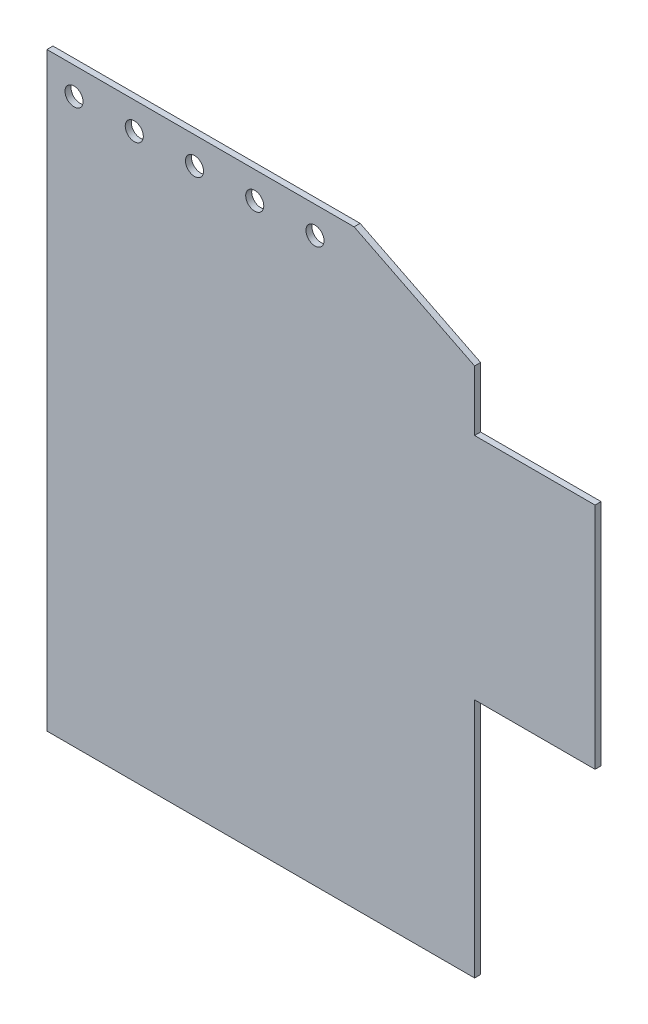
ISO-10303-21;
HEADER;
FILE_DESCRIPTION(('STEP AP214'),'2;1');
FILE_NAME('part.step','',(''),(''),'','','');
FILE_SCHEMA(('AUTOMOTIVE_DESIGN { 1 0 10303 214 1 1 1 1 }'));
ENDSEC;
DATA;
#1=APPLICATION_CONTEXT('core data for automotive mechanical design processes');
#2=APPLICATION_PROTOCOL_DEFINITION('international standard','automotive_design',2000,#1);
#3=PRODUCT_CONTEXT('',#1,'mechanical');
#4=PRODUCT('Part','Part','',(#3));
#5=PRODUCT_RELATED_PRODUCT_CATEGORY('part','',(#4));
#6=PRODUCT_DEFINITION_FORMATION('','',#4);
#7=PRODUCT_DEFINITION_CONTEXT('part definition',#1,'design');
#8=PRODUCT_DEFINITION('design','',#6,#7);
#9=PRODUCT_DEFINITION_SHAPE('','',#8);
#10=(LENGTH_UNIT() NAMED_UNIT(*) SI_UNIT(.MILLI.,.METRE.));
#11=(NAMED_UNIT(*) PLANE_ANGLE_UNIT() SI_UNIT($,.RADIAN.));
#12=(NAMED_UNIT(*) SI_UNIT($,.STERADIAN.) SOLID_ANGLE_UNIT());
#13=UNCERTAINTY_MEASURE_WITH_UNIT(LENGTH_MEASURE(1.E-05),#10,'distance_accuracy_value','');
#14=(GEOMETRIC_REPRESENTATION_CONTEXT(3) GLOBAL_UNCERTAINTY_ASSIGNED_CONTEXT((#13)) GLOBAL_UNIT_ASSIGNED_CONTEXT((#10,
#11,#12)) REPRESENTATION_CONTEXT('',''));
#15=CARTESIAN_POINT('',(0.,0.,0.));
#16=DIRECTION('',(0.,0.,1.));
#17=DIRECTION('',(1.,0.,0.));
#18=AXIS2_PLACEMENT_3D('',#15,#16,#17);
#19=CARTESIAN_POINT('',(0.,0.,1.));
#20=DIRECTION('',(0.,0.,-1.));
#21=DIRECTION('',(-1.,0.,0.));
#22=AXIS2_PLACEMENT_3D('',#19,#20,#21);
#23=PLANE('',#22);
#24=DIRECTION('',(-1.,0.,0.));
#25=VECTOR('',#24,1.);
#26=CARTESIAN_POINT('',(-14.9357271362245,46.1781779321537,1.));
#27=LINE('',#26,#25);
#28=CARTESIAN_POINT('',(36.0642728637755,46.1781779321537,1.));
#29=VERTEX_POINT('',#28);
#30=CARTESIAN_POINT('',(-14.9357271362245,46.1781779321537,1.));
#31=VERTEX_POINT('',#30);
#32=EDGE_CURVE('E153',#29,#31,#27,.T.);
#33=ORIENTED_EDGE('',*,*,#32,.T.);
#34=DIRECTION('',(0.,-1.,0.));
#35=VECTOR('',#34,1.);
#36=CARTESIAN_POINT('',(-14.9357271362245,46.1781779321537,1.));
#37=LINE('',#36,#35);
#38=CARTESIAN_POINT('',(-14.9357271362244,-51.8218220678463,1.));
#39=VERTEX_POINT('',#38);
#40=EDGE_CURVE('E96',#31,#39,#37,.T.);
#41=ORIENTED_EDGE('',*,*,#40,.T.);
#42=DIRECTION('',(1.,0.,0.));
#43=VECTOR('',#42,1.);
#44=CARTESIAN_POINT('',(-14.9357271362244,-51.8218220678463,1.));
#45=LINE('',#44,#43);
#46=CARTESIAN_POINT('',(56.0642728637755,-51.8218220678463,1.));
#47=VERTEX_POINT('',#46);
#48=EDGE_CURVE('E171',#39,#47,#45,.T.);
#49=ORIENTED_EDGE('',*,*,#48,.T.);
#50=DIRECTION('',(0.,1.,0.));
#51=VECTOR('',#50,1.);
#52=CARTESIAN_POINT('',(56.0642728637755,-11.8218220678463,1.));
#53=LINE('',#52,#51);
#54=CARTESIAN_POINT('',(56.0642728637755,-11.8218220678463,1.));
#55=VERTEX_POINT('',#54);
#56=EDGE_CURVE('E188',#47,#55,#53,.T.);
#57=ORIENTED_EDGE('',*,*,#56,.T.);
#58=DIRECTION('',(1.,0.,0.));
#59=VECTOR('',#58,1.);
#60=CARTESIAN_POINT('',(76.0642728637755,-11.8218220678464,1.));
#61=LINE('',#60,#59);
#62=CARTESIAN_POINT('',(76.0642728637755,-11.8218220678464,1.));
#63=VERTEX_POINT('',#62);
#64=EDGE_CURVE('E187',#55,#63,#61,.T.);
#65=ORIENTED_EDGE('',*,*,#64,.T.);
#66=DIRECTION('',(0.,1.,0.));
#67=VECTOR('',#66,1.);
#68=CARTESIAN_POINT('',(76.0642728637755,26.1781779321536,1.));
#69=LINE('',#68,#67);
#70=CARTESIAN_POINT('',(76.0642728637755,26.1781779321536,1.));
#71=VERTEX_POINT('',#70);
#72=EDGE_CURVE('E118',#63,#71,#69,.T.);
#73=ORIENTED_EDGE('',*,*,#72,.T.);
#74=DIRECTION('',(-1.,0.,0.));
#75=VECTOR('',#74,1.);
#76=CARTESIAN_POINT('',(76.0642728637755,26.1781779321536,1.));
#77=LINE('',#76,#75);
#78=CARTESIAN_POINT('',(56.0642728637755,26.1781779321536,1.));
#79=VERTEX_POINT('',#78);
#80=EDGE_CURVE('E112',#71,#79,#77,.T.);
#81=ORIENTED_EDGE('',*,*,#80,.T.);
#82=DIRECTION('',(0.,1.,0.));
#83=VECTOR('',#82,1.);
#84=CARTESIAN_POINT('',(56.0642728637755,36.1781779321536,1.));
#85=LINE('',#84,#83);
#86=CARTESIAN_POINT('',(56.0642728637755,36.1781779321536,1.));
#87=VERTEX_POINT('',#86);
#88=EDGE_CURVE('E116',#79,#87,#85,.T.);
#89=ORIENTED_EDGE('',*,*,#88,.T.);
#90=DIRECTION('',(-0.894427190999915,0.447213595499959,0.));
#91=VECTOR('',#90,1.);
#92=CARTESIAN_POINT('',(36.0642728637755,46.1781779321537,1.));
#93=LINE('',#92,#91);
#94=EDGE_CURVE('E50',#87,#29,#93,.T.);
#95=ORIENTED_EDGE('',*,*,#94,.T.);
#96=EDGE_LOOP('',(#33,#41,#49,#57,#65,#73,#81,#89,#95));
#97=FACE_BOUND('',#96,.T.);
#98=CARTESIAN_POINT('',(-10.4357271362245,41.6781779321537,1.));
#99=DIRECTION('',(0.,0.,1.));
#100=DIRECTION('',(1.,0.,0.));
#101=AXIS2_PLACEMENT_3D('',#98,#99,#100);
#102=CIRCLE('',#101,1.5);
#103=CARTESIAN_POINT('',(-8.93572713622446,41.6781779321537,1.));
#104=VERTEX_POINT('',#103);
#105=EDGE_CURVE('E140',#104,#104,#102,.T.);
#106=ORIENTED_EDGE('',*,*,#105,.F.);
#107=EDGE_LOOP('',(#106));
#108=FACE_BOUND('',#107,.T.);
#109=CARTESIAN_POINT('',(-0.435727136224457,41.6781779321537,1.));
#110=DIRECTION('',(0.,0.,1.));
#111=DIRECTION('',(1.,0.,0.));
#112=AXIS2_PLACEMENT_3D('',#109,#110,#111);
#113=CIRCLE('',#112,1.5);
#114=CARTESIAN_POINT('',(1.06427286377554,41.6781779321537,1.));
#115=VERTEX_POINT('',#114);
#116=EDGE_CURVE('E198',#115,#115,#113,.T.);
#117=ORIENTED_EDGE('',*,*,#116,.F.);
#118=EDGE_LOOP('',(#117));
#119=FACE_BOUND('',#118,.T.);
#120=CARTESIAN_POINT('',(9.56427286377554,41.6781779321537,1.));
#121=DIRECTION('',(0.,0.,1.));
#122=DIRECTION('',(1.,0.,0.));
#123=AXIS2_PLACEMENT_3D('',#120,#121,#122);
#124=CIRCLE('',#123,1.5);
#125=CARTESIAN_POINT('',(11.0642728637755,41.6781779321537,1.));
#126=VERTEX_POINT('',#125);
#127=EDGE_CURVE('E204',#126,#126,#124,.T.);
#128=ORIENTED_EDGE('',*,*,#127,.F.);
#129=EDGE_LOOP('',(#128));
#130=FACE_BOUND('',#129,.T.);
#131=CARTESIAN_POINT('',(19.5642728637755,41.6781779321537,1.));
#132=DIRECTION('',(0.,0.,1.));
#133=DIRECTION('',(1.,0.,0.));
#134=AXIS2_PLACEMENT_3D('',#131,#132,#133);
#135=CIRCLE('',#134,1.5);
#136=CARTESIAN_POINT('',(21.0642728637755,41.6781779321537,1.));
#137=VERTEX_POINT('',#136);
#138=EDGE_CURVE('E210',#137,#137,#135,.T.);
#139=ORIENTED_EDGE('',*,*,#138,.F.);
#140=EDGE_LOOP('',(#139));
#141=FACE_BOUND('',#140,.T.);
#142=CARTESIAN_POINT('',(29.5642728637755,41.6781779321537,1.));
#143=DIRECTION('',(0.,0.,1.));
#144=DIRECTION('',(1.,0.,0.));
#145=AXIS2_PLACEMENT_3D('',#142,#143,#144);
#146=CIRCLE('',#145,1.5);
#147=CARTESIAN_POINT('',(31.0642728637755,41.6781779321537,1.));
#148=VERTEX_POINT('',#147);
#149=EDGE_CURVE('E216',#148,#148,#146,.T.);
#150=ORIENTED_EDGE('',*,*,#149,.F.);
#151=EDGE_LOOP('',(#150));
#152=FACE_BOUND('',#151,.T.);
#153=ADVANCED_FACE('F33',(#97,#108,#119,#130,#141,#152),#23,.F.);
#154=CARTESIAN_POINT('',(0.,0.,0.));
#155=DIRECTION('',(0.,0.,-1.));
#156=DIRECTION('',(-1.,0.,0.));
#157=AXIS2_PLACEMENT_3D('',#154,#155,#156);
#158=PLANE('',#157);
#159=CARTESIAN_POINT('',(19.5642728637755,41.6781779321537,0.));
#160=DIRECTION('',(0.,0.,1.));
#161=DIRECTION('',(1.,0.,0.));
#162=AXIS2_PLACEMENT_3D('',#159,#160,#161);
#163=CIRCLE('',#162,1.5);
#164=CARTESIAN_POINT('',(21.0642728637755,41.6781779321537,0.));
#165=VERTEX_POINT('',#164);
#166=EDGE_CURVE('E213',#165,#165,#163,.T.);
#167=ORIENTED_EDGE('',*,*,#166,.T.);
#168=EDGE_LOOP('',(#167));
#169=FACE_BOUND('',#168,.T.);
#170=CARTESIAN_POINT('',(-0.435727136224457,41.6781779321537,0.));
#171=DIRECTION('',(0.,0.,1.));
#172=DIRECTION('',(1.,0.,0.));
#173=AXIS2_PLACEMENT_3D('',#170,#171,#172);
#174=CIRCLE('',#173,1.5);
#175=CARTESIAN_POINT('',(1.06427286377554,41.6781779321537,0.));
#176=VERTEX_POINT('',#175);
#177=EDGE_CURVE('E201',#176,#176,#174,.T.);
#178=ORIENTED_EDGE('',*,*,#177,.T.);
#179=EDGE_LOOP('',(#178));
#180=FACE_BOUND('',#179,.T.);
#181=DIRECTION('',(-1.,0.,0.));
#182=VECTOR('',#181,1.);
#183=CARTESIAN_POINT('',(-14.9357271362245,46.1781779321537,0.));
#184=LINE('',#183,#182);
#185=CARTESIAN_POINT('',(36.0642728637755,46.1781779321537,0.));
#186=VERTEX_POINT('',#185);
#187=CARTESIAN_POINT('',(-14.9357271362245,46.1781779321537,0.));
#188=VERTEX_POINT('',#187);
#189=EDGE_CURVE('E136',#186,#188,#184,.T.);
#190=ORIENTED_EDGE('',*,*,#189,.F.);
#191=DIRECTION('',(-0.894427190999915,0.447213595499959,0.));
#192=VECTOR('',#191,1.);
#193=CARTESIAN_POINT('',(36.0642728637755,46.1781779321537,0.));
#194=LINE('',#193,#192);
#195=CARTESIAN_POINT('',(56.0642728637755,36.1781779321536,0.));
#196=VERTEX_POINT('',#195);
#197=EDGE_CURVE('E88',#196,#186,#194,.T.);
#198=ORIENTED_EDGE('',*,*,#197,.F.);
#199=DIRECTION('',(0.,1.,0.));
#200=VECTOR('',#199,1.);
#201=CARTESIAN_POINT('',(56.0642728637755,36.1781779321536,0.));
#202=LINE('',#201,#200);
#203=CARTESIAN_POINT('',(56.0642728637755,26.1781779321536,0.));
#204=VERTEX_POINT('',#203);
#205=EDGE_CURVE('E82',#204,#196,#202,.T.);
#206=ORIENTED_EDGE('',*,*,#205,.F.);
#207=DIRECTION('',(-1.,0.,0.));
#208=VECTOR('',#207,1.);
#209=CARTESIAN_POINT('',(76.0642728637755,26.1781779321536,0.));
#210=LINE('',#209,#208);
#211=CARTESIAN_POINT('',(76.0642728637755,26.1781779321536,0.));
#212=VERTEX_POINT('',#211);
#213=EDGE_CURVE('E126',#212,#204,#210,.T.);
#214=ORIENTED_EDGE('',*,*,#213,.F.);
#215=DIRECTION('',(0.,1.,0.));
#216=VECTOR('',#215,1.);
#217=CARTESIAN_POINT('',(76.0642728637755,26.1781779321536,0.));
#218=LINE('',#217,#216);
#219=CARTESIAN_POINT('',(76.0642728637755,-11.8218220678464,0.));
#220=VERTEX_POINT('',#219);
#221=EDGE_CURVE('E148',#220,#212,#218,.T.);
#222=ORIENTED_EDGE('',*,*,#221,.F.);
#223=DIRECTION('',(1.,0.,0.));
#224=VECTOR('',#223,1.);
#225=CARTESIAN_POINT('',(76.0642728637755,-11.8218220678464,0.));
#226=LINE('',#225,#224);
#227=CARTESIAN_POINT('',(56.0642728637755,-11.8218220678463,0.));
#228=VERTEX_POINT('',#227);
#229=EDGE_CURVE('E146',#228,#220,#226,.T.);
#230=ORIENTED_EDGE('',*,*,#229,.F.);
#231=DIRECTION('',(0.,1.,0.));
#232=VECTOR('',#231,1.);
#233=CARTESIAN_POINT('',(56.0642728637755,-11.8218220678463,0.));
#234=LINE('',#233,#232);
#235=CARTESIAN_POINT('',(56.0642728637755,-51.8218220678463,0.));
#236=VERTEX_POINT('',#235);
#237=EDGE_CURVE('E144',#236,#228,#234,.T.);
#238=ORIENTED_EDGE('',*,*,#237,.F.);
#239=DIRECTION('',(1.,0.,0.));
#240=VECTOR('',#239,1.);
#241=CARTESIAN_POINT('',(-14.9357271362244,-51.8218220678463,0.));
#242=LINE('',#241,#240);
#243=CARTESIAN_POINT('',(-14.9357271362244,-51.8218220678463,0.));
#244=VERTEX_POINT('',#243);
#245=EDGE_CURVE('E142',#244,#236,#242,.T.);
#246=ORIENTED_EDGE('',*,*,#245,.F.);
#247=DIRECTION('',(0.,-1.,0.));
#248=VECTOR('',#247,1.);
#249=CARTESIAN_POINT('',(-14.9357271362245,46.1781779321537,0.));
#250=LINE('',#249,#248);
#251=EDGE_CURVE('E139',#188,#244,#250,.T.);
#252=ORIENTED_EDGE('',*,*,#251,.F.);
#253=EDGE_LOOP('',(#190,#198,#206,#214,#222,#230,#238,#246,#252));
#254=FACE_BOUND('',#253,.T.);
#255=CARTESIAN_POINT('',(-10.4357271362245,41.6781779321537,0.));
#256=DIRECTION('',(0.,0.,1.));
#257=DIRECTION('',(1.,0.,0.));
#258=AXIS2_PLACEMENT_3D('',#255,#256,#257);
#259=CIRCLE('',#258,1.5);
#260=CARTESIAN_POINT('',(-8.93572713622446,41.6781779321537,0.));
#261=VERTEX_POINT('',#260);
#262=EDGE_CURVE('E195',#261,#261,#259,.T.);
#263=ORIENTED_EDGE('',*,*,#262,.T.);
#264=EDGE_LOOP('',(#263));
#265=FACE_BOUND('',#264,.T.);
#266=CARTESIAN_POINT('',(9.56427286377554,41.6781779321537,0.));
#267=DIRECTION('',(0.,0.,1.));
#268=DIRECTION('',(1.,0.,0.));
#269=AXIS2_PLACEMENT_3D('',#266,#267,#268);
#270=CIRCLE('',#269,1.5);
#271=CARTESIAN_POINT('',(11.0642728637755,41.6781779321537,0.));
#272=VERTEX_POINT('',#271);
#273=EDGE_CURVE('E207',#272,#272,#270,.T.);
#274=ORIENTED_EDGE('',*,*,#273,.T.);
#275=EDGE_LOOP('',(#274));
#276=FACE_BOUND('',#275,.T.);
#277=CARTESIAN_POINT('',(29.5642728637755,41.6781779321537,0.));
#278=DIRECTION('',(0.,0.,1.));
#279=DIRECTION('',(1.,0.,0.));
#280=AXIS2_PLACEMENT_3D('',#277,#278,#279);
#281=CIRCLE('',#280,1.5);
#282=CARTESIAN_POINT('',(31.0642728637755,41.6781779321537,0.));
#283=VERTEX_POINT('',#282);
#284=EDGE_CURVE('E219',#283,#283,#281,.T.);
#285=ORIENTED_EDGE('',*,*,#284,.T.);
#286=EDGE_LOOP('',(#285));
#287=FACE_BOUND('',#286,.T.);
#288=ADVANCED_FACE('F175',(#169,#180,#254,#265,#276,#287),#158,.T.);
#289=CARTESIAN_POINT('',(-14.9357271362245,46.1781779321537,1.));
#290=DIRECTION('',(0.,-1.,0.));
#291=DIRECTION('',(0.,0.,-1.));
#292=AXIS2_PLACEMENT_3D('',#289,#290,#291);
#293=PLANE('',#292);
#294=ORIENTED_EDGE('',*,*,#189,.T.);
#295=DIRECTION('',(0.,0.,-1.));
#296=VECTOR('',#295,1.);
#297=CARTESIAN_POINT('',(-14.9357271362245,46.1781779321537,1.));
#298=LINE('',#297,#296);
#299=EDGE_CURVE('E11',#31,#188,#298,.T.);
#300=ORIENTED_EDGE('',*,*,#299,.F.);
#301=ORIENTED_EDGE('',*,*,#32,.F.);
#302=DIRECTION('',(0.,0.,-1.));
#303=VECTOR('',#302,1.);
#304=CARTESIAN_POINT('',(36.0642728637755,46.1781779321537,1.));
#305=LINE('',#304,#303);
#306=EDGE_CURVE('E132',#29,#186,#305,.T.);
#307=ORIENTED_EDGE('',*,*,#306,.T.);
#308=EDGE_LOOP('',(#294,#300,#301,#307));
#309=FACE_BOUND('',#308,.T.);
#310=ADVANCED_FACE('F35',(#309),#293,.F.);
#311=CARTESIAN_POINT('',(-14.9357271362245,46.1781779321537,1.));
#312=DIRECTION('',(1.,0.,0.));
#313=DIRECTION('',(0.,1.,0.));
#314=AXIS2_PLACEMENT_3D('',#311,#312,#313);
#315=PLANE('',#314);
#316=ORIENTED_EDGE('',*,*,#251,.T.);
#317=DIRECTION('',(0.,0.,-1.));
#318=VECTOR('',#317,1.);
#319=CARTESIAN_POINT('',(-14.9357271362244,-51.8218220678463,1.));
#320=LINE('',#319,#318);
#321=EDGE_CURVE('E42',#39,#244,#320,.T.);
#322=ORIENTED_EDGE('',*,*,#321,.F.);
#323=ORIENTED_EDGE('',*,*,#40,.F.);
#324=ORIENTED_EDGE('',*,*,#299,.T.);
#325=EDGE_LOOP('',(#316,#322,#323,#324));
#326=FACE_BOUND('',#325,.T.);
#327=ADVANCED_FACE('F255',(#326),#315,.F.);
#328=CARTESIAN_POINT('',(-14.9357271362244,-51.8218220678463,1.));
#329=DIRECTION('',(0.,1.,0.));
#330=DIRECTION('',(0.,0.,1.));
#331=AXIS2_PLACEMENT_3D('',#328,#329,#330);
#332=PLANE('',#331);
#333=ORIENTED_EDGE('',*,*,#245,.T.);
#334=DIRECTION('',(0.,0.,-1.));
#335=VECTOR('',#334,1.);
#336=CARTESIAN_POINT('',(56.0642728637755,-51.8218220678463,1.));
#337=LINE('',#336,#335);
#338=EDGE_CURVE('E163',#47,#236,#337,.T.);
#339=ORIENTED_EDGE('',*,*,#338,.F.);
#340=ORIENTED_EDGE('',*,*,#48,.F.);
#341=ORIENTED_EDGE('',*,*,#321,.T.);
#342=EDGE_LOOP('',(#333,#339,#340,#341));
#343=FACE_BOUND('',#342,.T.);
#344=ADVANCED_FACE('F169',(#343),#332,.F.);
#345=CARTESIAN_POINT('',(56.0642728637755,-11.8218220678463,1.));
#346=DIRECTION('',(-1.,0.,0.));
#347=DIRECTION('',(0.,-1.,0.));
#348=AXIS2_PLACEMENT_3D('',#345,#346,#347);
#349=PLANE('',#348);
#350=ORIENTED_EDGE('',*,*,#237,.T.);
#351=DIRECTION('',(0.,0.,-1.));
#352=VECTOR('',#351,1.);
#353=CARTESIAN_POINT('',(56.0642728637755,-11.8218220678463,1.));
#354=LINE('',#353,#352);
#355=EDGE_CURVE('E160',#55,#228,#354,.T.);
#356=ORIENTED_EDGE('',*,*,#355,.F.);
#357=ORIENTED_EDGE('',*,*,#56,.F.);
#358=ORIENTED_EDGE('',*,*,#338,.T.);
#359=EDGE_LOOP('',(#350,#356,#357,#358));
#360=FACE_BOUND('',#359,.T.);
#361=ADVANCED_FACE('F181',(#360),#349,.F.);
#362=CARTESIAN_POINT('',(76.0642728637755,-11.8218220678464,1.));
#363=DIRECTION('',(0.,1.,0.));
#364=DIRECTION('',(-1.,0.,0.));
#365=AXIS2_PLACEMENT_3D('',#362,#363,#364);
#366=PLANE('',#365);
#367=ORIENTED_EDGE('',*,*,#229,.T.);
#368=DIRECTION('',(0.,0.,-1.));
#369=VECTOR('',#368,1.);
#370=CARTESIAN_POINT('',(76.0642728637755,-11.8218220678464,1.));
#371=LINE('',#370,#369);
#372=EDGE_CURVE('E157',#63,#220,#371,.T.);
#373=ORIENTED_EDGE('',*,*,#372,.F.);
#374=ORIENTED_EDGE('',*,*,#64,.F.);
#375=ORIENTED_EDGE('',*,*,#355,.T.);
#376=EDGE_LOOP('',(#367,#373,#374,#375));
#377=FACE_BOUND('',#376,.T.);
#378=ADVANCED_FACE('F185',(#377),#366,.F.);
#379=CARTESIAN_POINT('',(76.0642728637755,26.1781779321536,1.));
#380=DIRECTION('',(-1.,0.,0.));
#381=DIRECTION('',(0.,-1.,0.));
#382=AXIS2_PLACEMENT_3D('',#379,#380,#381);
#383=PLANE('',#382);
#384=ORIENTED_EDGE('',*,*,#221,.T.);
#385=DIRECTION('',(0.,0.,-1.));
#386=VECTOR('',#385,1.);
#387=CARTESIAN_POINT('',(76.0642728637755,26.1781779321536,1.));
#388=LINE('',#387,#386);
#389=EDGE_CURVE('E127',#71,#212,#388,.T.);
#390=ORIENTED_EDGE('',*,*,#389,.F.);
#391=ORIENTED_EDGE('',*,*,#72,.F.);
#392=ORIENTED_EDGE('',*,*,#372,.T.);
#393=EDGE_LOOP('',(#384,#390,#391,#392));
#394=FACE_BOUND('',#393,.T.);
#395=ADVANCED_FACE('F246',(#394),#383,.F.);
#396=CARTESIAN_POINT('',(76.0642728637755,26.1781779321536,1.));
#397=DIRECTION('',(0.,-1.,0.));
#398=DIRECTION('',(0.,0.,-1.));
#399=AXIS2_PLACEMENT_3D('',#396,#397,#398);
#400=PLANE('',#399);
#401=ORIENTED_EDGE('',*,*,#213,.T.);
#402=DIRECTION('',(0.,0.,-1.));
#403=VECTOR('',#402,1.);
#404=CARTESIAN_POINT('',(56.0642728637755,26.1781779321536,1.));
#405=LINE('',#404,#403);
#406=EDGE_CURVE('E123',#79,#204,#405,.T.);
#407=ORIENTED_EDGE('',*,*,#406,.F.);
#408=ORIENTED_EDGE('',*,*,#80,.F.);
#409=ORIENTED_EDGE('',*,*,#389,.T.);
#410=EDGE_LOOP('',(#401,#407,#408,#409));
#411=FACE_BOUND('',#410,.T.);
#412=ADVANCED_FACE('F124',(#411),#400,.F.);
#413=CARTESIAN_POINT('',(56.0642728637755,36.1781779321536,1.));
#414=DIRECTION('',(-1.,0.,0.));
#415=DIRECTION('',(0.,-1.,0.));
#416=AXIS2_PLACEMENT_3D('',#413,#414,#415);
#417=PLANE('',#416);
#418=ORIENTED_EDGE('',*,*,#205,.T.);
#419=DIRECTION('',(0.,0.,-1.));
#420=VECTOR('',#419,1.);
#421=CARTESIAN_POINT('',(56.0642728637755,36.1781779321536,1.));
#422=LINE('',#421,#420);
#423=EDGE_CURVE('E128',#87,#196,#422,.T.);
#424=ORIENTED_EDGE('',*,*,#423,.F.);
#425=ORIENTED_EDGE('',*,*,#88,.F.);
#426=ORIENTED_EDGE('',*,*,#406,.T.);
#427=EDGE_LOOP('',(#418,#424,#425,#426));
#428=FACE_BOUND('',#427,.T.);
#429=ADVANCED_FACE('F130',(#428),#417,.F.);
#430=CARTESIAN_POINT('',(36.0642728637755,46.1781779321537,1.));
#431=DIRECTION('',(-0.447213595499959,-0.894427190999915,0.));
#432=DIRECTION('',(0.894427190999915,-0.447213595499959,0.));
#433=AXIS2_PLACEMENT_3D('',#430,#431,#432);
#434=PLANE('',#433);
#435=ORIENTED_EDGE('',*,*,#197,.T.);
#436=ORIENTED_EDGE('',*,*,#306,.F.);
#437=ORIENTED_EDGE('',*,*,#94,.F.);
#438=ORIENTED_EDGE('',*,*,#423,.T.);
#439=EDGE_LOOP('',(#435,#436,#437,#438));
#440=FACE_BOUND('',#439,.T.);
#441=ADVANCED_FACE('F239',(#440),#434,.F.);
#442=CARTESIAN_POINT('',(-10.4357271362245,41.6781779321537,1.));
#443=DIRECTION('',(0.,0.,-1.));
#444=DIRECTION('',(-1.,0.,0.));
#445=AXIS2_PLACEMENT_3D('',#442,#443,#444);
#446=CYLINDRICAL_SURFACE('',#445,1.5);
#447=ORIENTED_EDGE('',*,*,#105,.T.);
#448=EDGE_LOOP('',(#447));
#449=FACE_BOUND('',#448,.T.);
#450=ORIENTED_EDGE('',*,*,#262,.F.);
#451=EDGE_LOOP('',(#450));
#452=FACE_BOUND('',#451,.T.);
#453=ADVANCED_FACE('F236',(#449,#452),#446,.F.);
#454=CARTESIAN_POINT('',(-0.435727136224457,41.6781779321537,1.));
#455=DIRECTION('',(0.,0.,-1.));
#456=DIRECTION('',(-1.,0.,0.));
#457=AXIS2_PLACEMENT_3D('',#454,#455,#456);
#458=CYLINDRICAL_SURFACE('',#457,1.5);
#459=ORIENTED_EDGE('',*,*,#116,.T.);
#460=EDGE_LOOP('',(#459));
#461=FACE_BOUND('',#460,.T.);
#462=ORIENTED_EDGE('',*,*,#177,.F.);
#463=EDGE_LOOP('',(#462));
#464=FACE_BOUND('',#463,.T.);
#465=ADVANCED_FACE('F324',(#461,#464),#458,.F.);
#466=CARTESIAN_POINT('',(9.56427286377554,41.6781779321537,1.));
#467=DIRECTION('',(0.,0.,-1.));
#468=DIRECTION('',(-1.,0.,0.));
#469=AXIS2_PLACEMENT_3D('',#466,#467,#468);
#470=CYLINDRICAL_SURFACE('',#469,1.5);
#471=ORIENTED_EDGE('',*,*,#127,.T.);
#472=EDGE_LOOP('',(#471));
#473=FACE_BOUND('',#472,.T.);
#474=ORIENTED_EDGE('',*,*,#273,.F.);
#475=EDGE_LOOP('',(#474));
#476=FACE_BOUND('',#475,.T.);
#477=ADVANCED_FACE('F332',(#473,#476),#470,.F.);
#478=CARTESIAN_POINT('',(19.5642728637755,41.6781779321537,1.));
#479=DIRECTION('',(0.,0.,-1.));
#480=DIRECTION('',(-1.,0.,0.));
#481=AXIS2_PLACEMENT_3D('',#478,#479,#480);
#482=CYLINDRICAL_SURFACE('',#481,1.5);
#483=ORIENTED_EDGE('',*,*,#138,.T.);
#484=EDGE_LOOP('',(#483));
#485=FACE_BOUND('',#484,.T.);
#486=ORIENTED_EDGE('',*,*,#166,.F.);
#487=EDGE_LOOP('',(#486));
#488=FACE_BOUND('',#487,.T.);
#489=ADVANCED_FACE('F340',(#485,#488),#482,.F.);
#490=CARTESIAN_POINT('',(29.5642728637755,41.6781779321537,1.));
#491=DIRECTION('',(0.,0.,-1.));
#492=DIRECTION('',(-1.,0.,0.));
#493=AXIS2_PLACEMENT_3D('',#490,#491,#492);
#494=CYLINDRICAL_SURFACE('',#493,1.5);
#495=ORIENTED_EDGE('',*,*,#149,.T.);
#496=EDGE_LOOP('',(#495));
#497=FACE_BOUND('',#496,.T.);
#498=ORIENTED_EDGE('',*,*,#284,.F.);
#499=EDGE_LOOP('',(#498));
#500=FACE_BOUND('',#499,.T.);
#501=ADVANCED_FACE('F225',(#497,#500),#494,.F.);
#502=CLOSED_SHELL('',(#153,#288,#310,#327,#344,#361,#378,#395,#412,#429,#441,#453,#465,#477,
#489,#501));
#503=MANIFOLD_SOLID_BREP('B2',#502);
#504=ADVANCED_BREP_SHAPE_REPRESENTATION('',(#18,#503),#14);
#505=SHAPE_DEFINITION_REPRESENTATION(#9,#504);
ENDSEC;
END-ISO-10303-21;
